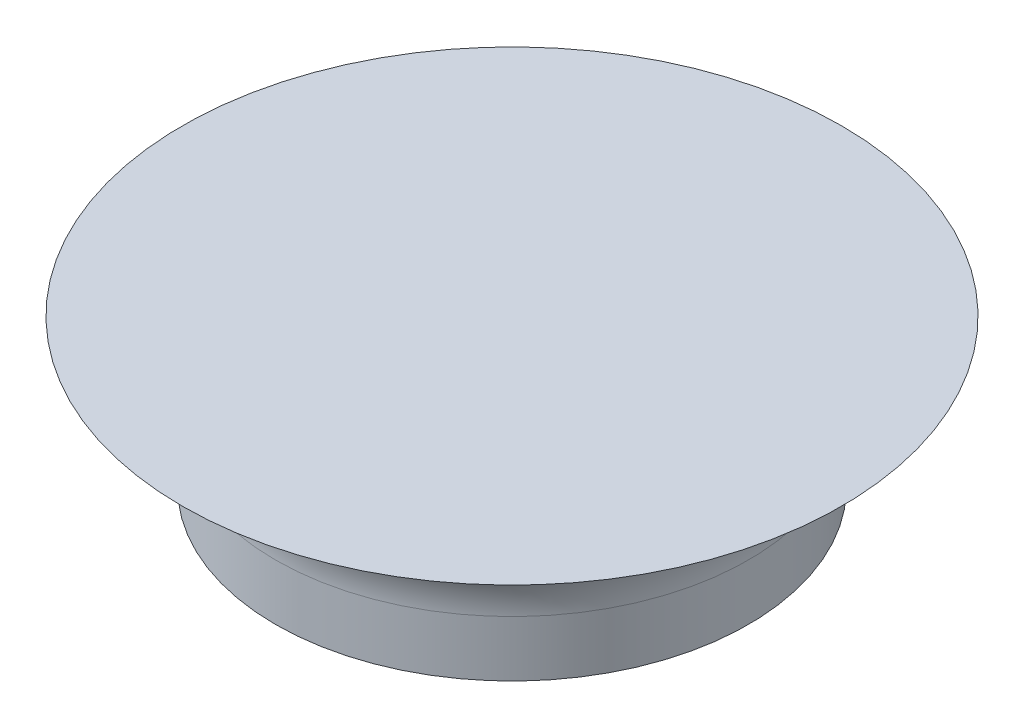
from build123d import *

# Parameters (mm, degrees)
SKETCH1_W          = 50
SKETCH1_H          = 5
BASE_EXTRUDE_DEPTH = 25
SKETCH5_W          = 6.35
SKETCH5_H          = 4
FILLET3_R          = 2.5
SKETCH6_W          = 50
SKETCH6_H          = 5
CUT_EXTRUDE2_DEPTH = 57.124860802


with BuildPart() as part:
    # Sketch1 → Base-Extrude (new, symmetric)
    with BuildSketch(Plane.XY):
        with Locations((0, 2.5)):
            Rectangle(SKETCH1_W, SKETCH1_H)
    extrude(amount=BASE_EXTRUDE_DEPTH, both=True)

    # Sketch5 → Boss-Revolve1 (revolve)
    with BuildSketch(Plane.XY, mode=Mode.PRIVATE) as boss_revolve1_sk:
        with Locations((3.175, -2)):
            Rectangle(SKETCH5_W, SKETCH5_H)
    revolve(boss_revolve1_sk.sketch.rotate(Axis((0, 0, 0), (0, -1, 0)), 90), axis=Axis((0, 0, 0), (0, -1, 0)))

    # Fillet3
    fillet3_edges = [part.edges().sort_by_distance(p)[0] for p in [
        (0, 0, -6.35),
    ]]
    fillet(fillet3_edges, radius=FILLET3_R)

    # Sketch6 → Cut-Extrude2 (cut, through all)
    with BuildSketch(Plane(origin=(25, 0, 0), x_dir=(0, 0, -1), z_dir=(1, 0, 0))):
        with Locations((0, 2.5)):
            Rectangle(SKETCH6_W, SKETCH6_H)
    extrude(amount=-CUT_EXTRUDE2_DEPTH, mode=Mode.SUBTRACT)


solid = part.part
